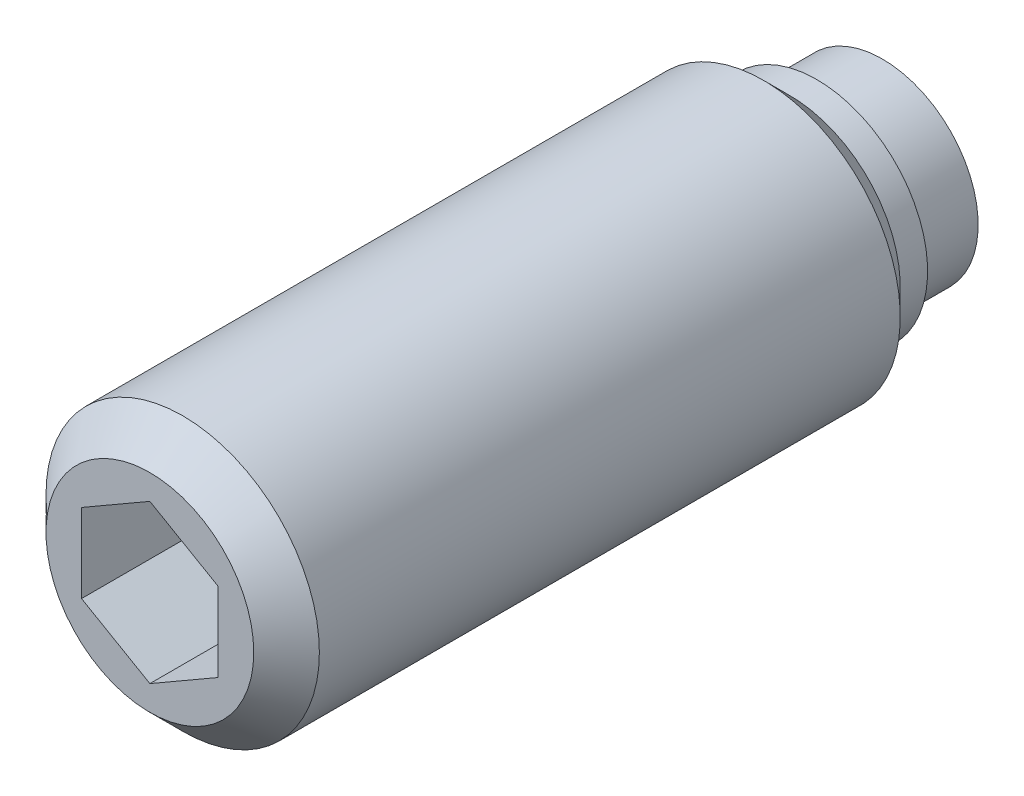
ISO-10303-21;
HEADER;
FILE_DESCRIPTION(('STEP AP214'),'2;1');
FILE_NAME('part.step','',(''),(''),'','','');
FILE_SCHEMA(('AUTOMOTIVE_DESIGN { 1 0 10303 214 1 1 1 1 }'));
ENDSEC;
DATA;
#1=APPLICATION_CONTEXT('core data for automotive mechanical design processes');
#2=APPLICATION_PROTOCOL_DEFINITION('international standard','automotive_design',2000,#1);
#3=PRODUCT_CONTEXT('',#1,'mechanical');
#4=PRODUCT('Part','Part','',(#3));
#5=PRODUCT_RELATED_PRODUCT_CATEGORY('part','',(#4));
#6=PRODUCT_DEFINITION_FORMATION('','',#4);
#7=PRODUCT_DEFINITION_CONTEXT('part definition',#1,'design');
#8=PRODUCT_DEFINITION('design','',#6,#7);
#9=PRODUCT_DEFINITION_SHAPE('','',#8);
#10=(LENGTH_UNIT() NAMED_UNIT(*) SI_UNIT(.MILLI.,.METRE.));
#11=(NAMED_UNIT(*) PLANE_ANGLE_UNIT() SI_UNIT($,.RADIAN.));
#12=(NAMED_UNIT(*) SI_UNIT($,.STERADIAN.) SOLID_ANGLE_UNIT());
#13=UNCERTAINTY_MEASURE_WITH_UNIT(LENGTH_MEASURE(1.E-05),#10,'distance_accuracy_value','');
#14=(GEOMETRIC_REPRESENTATION_CONTEXT(3) GLOBAL_UNCERTAINTY_ASSIGNED_CONTEXT((#13)) GLOBAL_UNIT_ASSIGNED_CONTEXT((#10,
#11,#12)) REPRESENTATION_CONTEXT('',''));
#15=CARTESIAN_POINT('',(0.,0.,0.));
#16=DIRECTION('',(0.,0.,1.));
#17=DIRECTION('',(1.,0.,0.));
#18=AXIS2_PLACEMENT_3D('',#15,#16,#17);
#19=CARTESIAN_POINT('',(0.,4.05,3.5));
#20=DIRECTION('',(0.,0.,1.));
#21=DIRECTION('',(1.,0.,0.));
#22=AXIS2_PLACEMENT_3D('',#19,#20,#21);
#23=PLANE('',#22);
#24=CARTESIAN_POINT('',(0.,0.,3.5));
#25=DIRECTION('',(0.,0.,-1.));
#26=DIRECTION('',(-1.,0.,0.));
#27=AXIS2_PLACEMENT_3D('',#24,#25,#26);
#28=CIRCLE('',#27,3.5);
#29=CARTESIAN_POINT('',(-3.50000000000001,0.,3.5));
#30=VERTEX_POINT('',#29);
#31=EDGE_CURVE('E124',#30,#30,#28,.T.);
#32=ORIENTED_EDGE('',*,*,#31,.F.);
#33=EDGE_LOOP('',(#32));
#34=FACE_BOUND('',#33,.T.);
#35=CARTESIAN_POINT('',(0.,0.,3.5));
#36=DIRECTION('',(0.,0.,-1.));
#37=DIRECTION('',(-1.,0.,0.));
#38=AXIS2_PLACEMENT_3D('',#35,#36,#37);
#39=CIRCLE('',#38,4.05);
#40=CARTESIAN_POINT('',(-4.05000000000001,0.,3.5));
#41=VERTEX_POINT('',#40);
#42=EDGE_CURVE('E127',#41,#41,#39,.T.);
#43=ORIENTED_EDGE('',*,*,#42,.T.);
#44=EDGE_LOOP('',(#43));
#45=FACE_BOUND('',#44,.T.);
#46=ADVANCED_FACE('F14',(#34,#45),#23,.F.);
#47=CARTESIAN_POINT('',(0.,0.,3.5));
#48=DIRECTION('',(0.,0.,-1.));
#49=DIRECTION('',(-1.,0.,0.));
#50=AXIS2_PLACEMENT_3D('',#47,#48,#49);
#51=CYLINDRICAL_SURFACE('',#50,5.);
#52=CARTESIAN_POINT('',(0.,0.,26.7));
#53=DIRECTION('',(0.,0.,1.));
#54=DIRECTION('',(1.,0.,0.));
#55=AXIS2_PLACEMENT_3D('',#52,#53,#54);
#56=CIRCLE('',#55,5.);
#57=CARTESIAN_POINT('',(4.99999999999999,0.,26.7));
#58=VERTEX_POINT('',#57);
#59=EDGE_CURVE('E9',#58,#58,#56,.F.);
#60=ORIENTED_EDGE('',*,*,#59,.T.);
#61=EDGE_LOOP('',(#60));
#62=FACE_BOUND('',#61,.T.);
#63=CARTESIAN_POINT('',(0.,0.,5.45));
#64=DIRECTION('',(0.,0.,-1.));
#65=DIRECTION('',(-1.,0.,0.));
#66=AXIS2_PLACEMENT_3D('',#63,#64,#65);
#67=CIRCLE('',#66,5.);
#68=CARTESIAN_POINT('',(-5.00000000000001,0.,5.45));
#69=VERTEX_POINT('',#68);
#70=EDGE_CURVE('E133',#69,#69,#67,.T.);
#71=ORIENTED_EDGE('',*,*,#70,.F.);
#72=EDGE_LOOP('',(#71));
#73=FACE_BOUND('',#72,.T.);
#74=ADVANCED_FACE('F151',(#62,#73),#51,.T.);
#75=CARTESIAN_POINT('',(0.,0.,5.45));
#76=DIRECTION('',(0.,0.,1.));
#77=DIRECTION('',(1.,0.,0.));
#78=AXIS2_PLACEMENT_3D('',#75,#76,#77);
#79=CONICAL_SURFACE('',#78,5.,0.785398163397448);
#80=CARTESIAN_POINT('',(0.,0.,4.5));
#81=DIRECTION('',(0.,0.,-1.));
#82=DIRECTION('',(-1.,0.,0.));
#83=AXIS2_PLACEMENT_3D('',#80,#81,#82);
#84=CIRCLE('',#83,4.05);
#85=CARTESIAN_POINT('',(-4.05000000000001,0.,4.5));
#86=VERTEX_POINT('',#85);
#87=EDGE_CURVE('E130',#86,#86,#84,.T.);
#88=ORIENTED_EDGE('',*,*,#87,.F.);
#89=EDGE_LOOP('',(#88));
#90=FACE_BOUND('',#89,.T.);
#91=ORIENTED_EDGE('',*,*,#70,.T.);
#92=EDGE_LOOP('',(#91));
#93=FACE_BOUND('',#92,.T.);
#94=ADVANCED_FACE('F158',(#90,#93),#79,.T.);
#95=CARTESIAN_POINT('',(0.,0.,3.5));
#96=DIRECTION('',(0.,0.,-1.));
#97=DIRECTION('',(-1.,0.,0.));
#98=AXIS2_PLACEMENT_3D('',#95,#96,#97);
#99=CYLINDRICAL_SURFACE('',#98,4.05);
#100=ORIENTED_EDGE('',*,*,#42,.F.);
#101=EDGE_LOOP('',(#100));
#102=FACE_BOUND('',#101,.T.);
#103=ORIENTED_EDGE('',*,*,#87,.T.);
#104=EDGE_LOOP('',(#103));
#105=FACE_BOUND('',#104,.T.);
#106=ADVANCED_FACE('F166',(#102,#105),#99,.T.);
#107=CARTESIAN_POINT('',(0.,0.,0.));
#108=DIRECTION('',(0.,0.,-1.));
#109=DIRECTION('',(-1.,0.,0.));
#110=AXIS2_PLACEMENT_3D('',#107,#108,#109);
#111=CYLINDRICAL_SURFACE('',#110,3.5);
#112=CARTESIAN_POINT('',(0.,0.,1.1));
#113=DIRECTION('',(0.,0.,-1.));
#114=DIRECTION('',(-1.,0.,0.));
#115=AXIS2_PLACEMENT_3D('',#112,#113,#114);
#116=CIRCLE('',#115,3.5);
#117=CARTESIAN_POINT('',(-3.50000000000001,0.,1.1));
#118=VERTEX_POINT('',#117);
#119=EDGE_CURVE('E114',#118,#118,#116,.T.);
#120=ORIENTED_EDGE('',*,*,#119,.F.);
#121=EDGE_LOOP('',(#120));
#122=FACE_BOUND('',#121,.T.);
#123=ORIENTED_EDGE('',*,*,#31,.T.);
#124=EDGE_LOOP('',(#123));
#125=FACE_BOUND('',#124,.T.);
#126=ADVANCED_FACE('F164',(#122,#125),#111,.T.);
#127=CARTESIAN_POINT('',(-0.0371790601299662,0.,5.9998848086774));
#128=DIRECTION('',(0.,-1.,0.));
#129=DIRECTION('',(-1.,0.,0.));
#130=AXIS2_PLACEMENT_3D('',#127,#128,#129);
#131=CIRCLE('',#130,5.99999999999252);
#132=TRIMMED_CURVE('',#131,(PARAMETER_VALUE(-1.57699287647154)),
(PARAMETER_VALUE(1.57699287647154)),.T.,.PARAMETER.);
#133=CARTESIAN_POINT('',(0.,0.,5.9998848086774));
#134=DIRECTION('',(0.,0.,-1.));
#135=AXIS1_PLACEMENT('',#133,#134);
#136=SURFACE_OF_REVOLUTION('',#132,#135);
#137=ORIENTED_EDGE('',*,*,#119,.T.);
#138=EDGE_LOOP('',(#137));
#139=FACE_BOUND('',#138,.T.);
#140=CARTESIAN_POINT('',(0.,0.,0.));
#141=VERTEX_POINT('',#140);
#142=VERTEX_LOOP('',#141);
#143=FACE_BOUND('',#142,.T.);
#144=ADVANCED_FACE('F198',(#139,#143),#136,.T.);
#145=CARTESIAN_POINT('',(0.,0.,27.9));
#146=DIRECTION('',(0.,0.,1.));
#147=DIRECTION('',(1.,0.,0.));
#148=AXIS2_PLACEMENT_3D('',#145,#146,#147);
#149=PLANE('',#148);
#150=CARTESIAN_POINT('',(0.,0.,27.9));
#151=DIRECTION('',(0.,0.,1.));
#152=DIRECTION('',(1.,0.,0.));
#153=AXIS2_PLACEMENT_3D('',#150,#151,#152);
#154=CIRCLE('',#153,3.8);
#155=CARTESIAN_POINT('',(3.79999999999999,0.,27.9));
#156=VERTEX_POINT('',#155);
#157=EDGE_CURVE('E22',#156,#156,#154,.T.);
#158=ORIENTED_EDGE('',*,*,#157,.T.);
#159=EDGE_LOOP('',(#158));
#160=FACE_BOUND('',#159,.T.);
#161=DIRECTION('',(-0.866025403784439,0.5,0.));
#162=VECTOR('',#161,1.);
#163=CARTESIAN_POINT('',(2.5,1.44337567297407,27.9));
#164=LINE('',#163,#162);
#165=CARTESIAN_POINT('',(2.5,1.44337567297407,27.9));
#166=VERTEX_POINT('',#165);
#167=CARTESIAN_POINT('',(0.,2.88675134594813,27.9));
#168=VERTEX_POINT('',#167);
#169=EDGE_CURVE('E29',#166,#168,#164,.T.);
#170=ORIENTED_EDGE('',*,*,#169,.F.);
#171=DIRECTION('',(0.,1.,0.));
#172=VECTOR('',#171,1.);
#173=CARTESIAN_POINT('',(2.5,-1.44337567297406,27.9));
#174=LINE('',#173,#172);
#175=CARTESIAN_POINT('',(2.5,-1.44337567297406,27.9));
#176=VERTEX_POINT('',#175);
#177=EDGE_CURVE('E88',#176,#166,#174,.T.);
#178=ORIENTED_EDGE('',*,*,#177,.F.);
#179=DIRECTION('',(0.866025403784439,0.5,0.));
#180=VECTOR('',#179,1.);
#181=CARTESIAN_POINT('',(0.,-2.88675134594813,27.9));
#182=LINE('',#181,#180);
#183=CARTESIAN_POINT('',(0.,-2.88675134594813,27.9));
#184=VERTEX_POINT('',#183);
#185=EDGE_CURVE('E91',#184,#176,#182,.T.);
#186=ORIENTED_EDGE('',*,*,#185,.F.);
#187=DIRECTION('',(0.866025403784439,-0.5,0.));
#188=VECTOR('',#187,1.);
#189=CARTESIAN_POINT('',(-2.5,-1.44337567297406,27.9));
#190=LINE('',#189,#188);
#191=CARTESIAN_POINT('',(-2.5,-1.44337567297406,27.9));
#192=VERTEX_POINT('',#191);
#193=EDGE_CURVE('E107',#192,#184,#190,.T.);
#194=ORIENTED_EDGE('',*,*,#193,.F.);
#195=DIRECTION('',(0.,-1.,0.));
#196=VECTOR('',#195,1.);
#197=CARTESIAN_POINT('',(-2.5,1.44337567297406,27.9));
#198=LINE('',#197,#196);
#199=CARTESIAN_POINT('',(-2.5,1.44337567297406,27.9));
#200=VERTEX_POINT('',#199);
#201=EDGE_CURVE('E104',#200,#192,#198,.T.);
#202=ORIENTED_EDGE('',*,*,#201,.F.);
#203=DIRECTION('',(-0.866025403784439,-0.5,0.));
#204=VECTOR('',#203,1.);
#205=CARTESIAN_POINT('',(0.,2.88675134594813,27.9));
#206=LINE('',#205,#204);
#207=EDGE_CURVE('E102',#168,#200,#206,.T.);
#208=ORIENTED_EDGE('',*,*,#207,.F.);
#209=EDGE_LOOP('',(#170,#178,#186,#194,#202,#208));
#210=FACE_BOUND('',#209,.T.);
#211=ADVANCED_FACE('F138',(#160,#210),#149,.T.);
#212=CARTESIAN_POINT('',(2.5,1.44337567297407,21.9));
#213=DIRECTION('',(0.5,0.866025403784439,0.));
#214=DIRECTION('',(-0.866025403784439,0.5,0.));
#215=AXIS2_PLACEMENT_3D('',#212,#213,#214);
#216=PLANE('',#215);
#217=ORIENTED_EDGE('',*,*,#169,.T.);
#218=DIRECTION('',(0.,0.,1.));
#219=VECTOR('',#218,1.);
#220=CARTESIAN_POINT('',(0.,2.88675134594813,21.9));
#221=LINE('',#220,#219);
#222=CARTESIAN_POINT('',(0.,2.88675134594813,21.9));
#223=VERTEX_POINT('',#222);
#224=EDGE_CURVE('E65',#223,#168,#221,.T.);
#225=ORIENTED_EDGE('',*,*,#224,.F.);
#226=DIRECTION('',(-0.866025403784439,0.5,0.));
#227=VECTOR('',#226,1.);
#228=CARTESIAN_POINT('',(2.5,1.44337567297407,21.9));
#229=LINE('',#228,#227);
#230=CARTESIAN_POINT('',(2.5,1.44337567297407,21.9));
#231=VERTEX_POINT('',#230);
#232=EDGE_CURVE('E69',#231,#223,#229,.T.);
#233=ORIENTED_EDGE('',*,*,#232,.F.);
#234=DIRECTION('',(0.,0.,1.));
#235=VECTOR('',#234,1.);
#236=CARTESIAN_POINT('',(2.5,1.44337567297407,21.9));
#237=LINE('',#236,#235);
#238=EDGE_CURVE('E112',#231,#166,#237,.T.);
#239=ORIENTED_EDGE('',*,*,#238,.T.);
#240=EDGE_LOOP('',(#217,#225,#233,#239));
#241=FACE_BOUND('',#240,.T.);
#242=ADVANCED_FACE('F67',(#241),#216,.F.);
#243=CARTESIAN_POINT('',(2.5,-1.44337567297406,21.9));
#244=DIRECTION('',(1.,0.,0.));
#245=DIRECTION('',(0.,0.,-1.));
#246=AXIS2_PLACEMENT_3D('',#243,#244,#245);
#247=PLANE('',#246);
#248=ORIENTED_EDGE('',*,*,#177,.T.);
#249=ORIENTED_EDGE('',*,*,#238,.F.);
#250=DIRECTION('',(0.,1.,0.));
#251=VECTOR('',#250,1.);
#252=CARTESIAN_POINT('',(2.5,-1.44337567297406,21.9));
#253=LINE('',#252,#251);
#254=CARTESIAN_POINT('',(2.5,-1.44337567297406,21.9));
#255=VERTEX_POINT('',#254);
#256=EDGE_CURVE('E75',#255,#231,#253,.T.);
#257=ORIENTED_EDGE('',*,*,#256,.F.);
#258=DIRECTION('',(0.,0.,1.));
#259=VECTOR('',#258,1.);
#260=CARTESIAN_POINT('',(2.5,-1.44337567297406,21.9));
#261=LINE('',#260,#259);
#262=EDGE_CURVE('E115',#255,#176,#261,.T.);
#263=ORIENTED_EDGE('',*,*,#262,.T.);
#264=EDGE_LOOP('',(#248,#249,#257,#263));
#265=FACE_BOUND('',#264,.T.);
#266=ADVANCED_FACE('F220',(#265),#247,.F.);
#267=CARTESIAN_POINT('',(0.,-2.88675134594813,21.9));
#268=DIRECTION('',(0.5,-0.866025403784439,0.));
#269=DIRECTION('',(0.866025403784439,0.5,0.));
#270=AXIS2_PLACEMENT_3D('',#267,#268,#269);
#271=PLANE('',#270);
#272=ORIENTED_EDGE('',*,*,#185,.T.);
#273=ORIENTED_EDGE('',*,*,#262,.F.);
#274=DIRECTION('',(0.866025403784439,0.5,0.));
#275=VECTOR('',#274,1.);
#276=CARTESIAN_POINT('',(0.,-2.88675134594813,21.9));
#277=LINE('',#276,#275);
#278=CARTESIAN_POINT('',(0.,-2.88675134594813,21.9));
#279=VERTEX_POINT('',#278);
#280=EDGE_CURVE('E98',#279,#255,#277,.T.);
#281=ORIENTED_EDGE('',*,*,#280,.F.);
#282=DIRECTION('',(0.,0.,1.));
#283=VECTOR('',#282,1.);
#284=CARTESIAN_POINT('',(0.,-2.88675134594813,21.9));
#285=LINE('',#284,#283);
#286=EDGE_CURVE('E117',#279,#184,#285,.T.);
#287=ORIENTED_EDGE('',*,*,#286,.T.);
#288=EDGE_LOOP('',(#272,#273,#281,#287));
#289=FACE_BOUND('',#288,.T.);
#290=ADVANCED_FACE('F228',(#289),#271,.F.);
#291=CARTESIAN_POINT('',(-2.5,-1.44337567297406,21.9));
#292=DIRECTION('',(-0.5,-0.866025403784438,0.));
#293=DIRECTION('',(0.866025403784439,-0.5,0.));
#294=AXIS2_PLACEMENT_3D('',#291,#292,#293);
#295=PLANE('',#294);
#296=ORIENTED_EDGE('',*,*,#193,.T.);
#297=ORIENTED_EDGE('',*,*,#286,.F.);
#298=DIRECTION('',(0.866025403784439,-0.5,0.));
#299=VECTOR('',#298,1.);
#300=CARTESIAN_POINT('',(-2.5,-1.44337567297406,21.9));
#301=LINE('',#300,#299);
#302=CARTESIAN_POINT('',(-2.5,-1.44337567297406,21.9));
#303=VERTEX_POINT('',#302);
#304=EDGE_CURVE('E95',#303,#279,#301,.T.);
#305=ORIENTED_EDGE('',*,*,#304,.F.);
#306=DIRECTION('',(0.,0.,1.));
#307=VECTOR('',#306,1.);
#308=CARTESIAN_POINT('',(-2.5,-1.44337567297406,21.9));
#309=LINE('',#308,#307);
#310=EDGE_CURVE('E119',#303,#192,#309,.T.);
#311=ORIENTED_EDGE('',*,*,#310,.T.);
#312=EDGE_LOOP('',(#296,#297,#305,#311));
#313=FACE_BOUND('',#312,.T.);
#314=ADVANCED_FACE('F237',(#313),#295,.F.);
#315=CARTESIAN_POINT('',(-2.5,1.44337567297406,21.9));
#316=DIRECTION('',(-1.,0.,0.));
#317=DIRECTION('',(0.,0.,1.));
#318=AXIS2_PLACEMENT_3D('',#315,#316,#317);
#319=PLANE('',#318);
#320=ORIENTED_EDGE('',*,*,#201,.T.);
#321=ORIENTED_EDGE('',*,*,#310,.F.);
#322=DIRECTION('',(0.,-1.,0.));
#323=VECTOR('',#322,1.);
#324=CARTESIAN_POINT('',(-2.5,1.44337567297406,21.9));
#325=LINE('',#324,#323);
#326=CARTESIAN_POINT('',(-2.5,1.44337567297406,21.9));
#327=VERTEX_POINT('',#326);
#328=EDGE_CURVE('E83',#327,#303,#325,.T.);
#329=ORIENTED_EDGE('',*,*,#328,.F.);
#330=DIRECTION('',(0.,0.,1.));
#331=VECTOR('',#330,1.);
#332=CARTESIAN_POINT('',(-2.5,1.44337567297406,21.9));
#333=LINE('',#332,#331);
#334=EDGE_CURVE('E74',#327,#200,#333,.T.);
#335=ORIENTED_EDGE('',*,*,#334,.T.);
#336=EDGE_LOOP('',(#320,#321,#329,#335));
#337=FACE_BOUND('',#336,.T.);
#338=ADVANCED_FACE('F246',(#337),#319,.F.);
#339=CARTESIAN_POINT('',(0.,2.88675134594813,21.9));
#340=DIRECTION('',(-0.5,0.866025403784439,0.));
#341=DIRECTION('',(-0.866025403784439,-0.5,0.));
#342=AXIS2_PLACEMENT_3D('',#339,#340,#341);
#343=PLANE('',#342);
#344=ORIENTED_EDGE('',*,*,#207,.T.);
#345=ORIENTED_EDGE('',*,*,#334,.F.);
#346=DIRECTION('',(-0.866025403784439,-0.5,0.));
#347=VECTOR('',#346,1.);
#348=CARTESIAN_POINT('',(0.,2.88675134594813,21.9));
#349=LINE('',#348,#347);
#350=EDGE_CURVE('E78',#223,#327,#349,.T.);
#351=ORIENTED_EDGE('',*,*,#350,.F.);
#352=ORIENTED_EDGE('',*,*,#224,.T.);
#353=EDGE_LOOP('',(#344,#345,#351,#352));
#354=FACE_BOUND('',#353,.T.);
#355=ADVANCED_FACE('F79',(#354),#343,.F.);
#356=CARTESIAN_POINT('',(0.,0.,21.9));
#357=DIRECTION('',(0.,0.,1.));
#358=DIRECTION('',(1.,0.,0.));
#359=AXIS2_PLACEMENT_3D('',#356,#357,#358);
#360=PLANE('',#359);
#361=ORIENTED_EDGE('',*,*,#232,.T.);
#362=ORIENTED_EDGE('',*,*,#350,.T.);
#363=ORIENTED_EDGE('',*,*,#328,.T.);
#364=ORIENTED_EDGE('',*,*,#304,.T.);
#365=ORIENTED_EDGE('',*,*,#280,.T.);
#366=ORIENTED_EDGE('',*,*,#256,.T.);
#367=EDGE_LOOP('',(#361,#362,#363,#364,#365,#366));
#368=FACE_BOUND('',#367,.T.);
#369=ADVANCED_FACE('F85',(#368),#360,.T.);
#370=CARTESIAN_POINT('',(0.,0.,27.9));
#371=DIRECTION('',(0.,0.,-1.));
#372=DIRECTION('',(-1.,0.,0.));
#373=AXIS2_PLACEMENT_3D('',#370,#371,#372);
#374=CONICAL_SURFACE('',#373,3.8,0.785398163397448);
#375=ORIENTED_EDGE('',*,*,#59,.F.);
#376=EDGE_LOOP('',(#375));
#377=FACE_BOUND('',#376,.T.);
#378=ORIENTED_EDGE('',*,*,#157,.F.);
#379=EDGE_LOOP('',(#378));
#380=FACE_BOUND('',#379,.T.);
#381=ADVANCED_FACE('F16',(#377,#380),#374,.T.);
#382=CLOSED_SHELL('',(#46,#74,#94,#106,#126,#144,#211,#242,#266,#290,#314,#338,#355,#369,#381));
#383=MANIFOLD_SOLID_BREP('B1',#382);
#384=ADVANCED_BREP_SHAPE_REPRESENTATION('',(#18,#383),#14);
#385=SHAPE_DEFINITION_REPRESENTATION(#9,#384);
ENDSEC;
END-ISO-10303-21;
